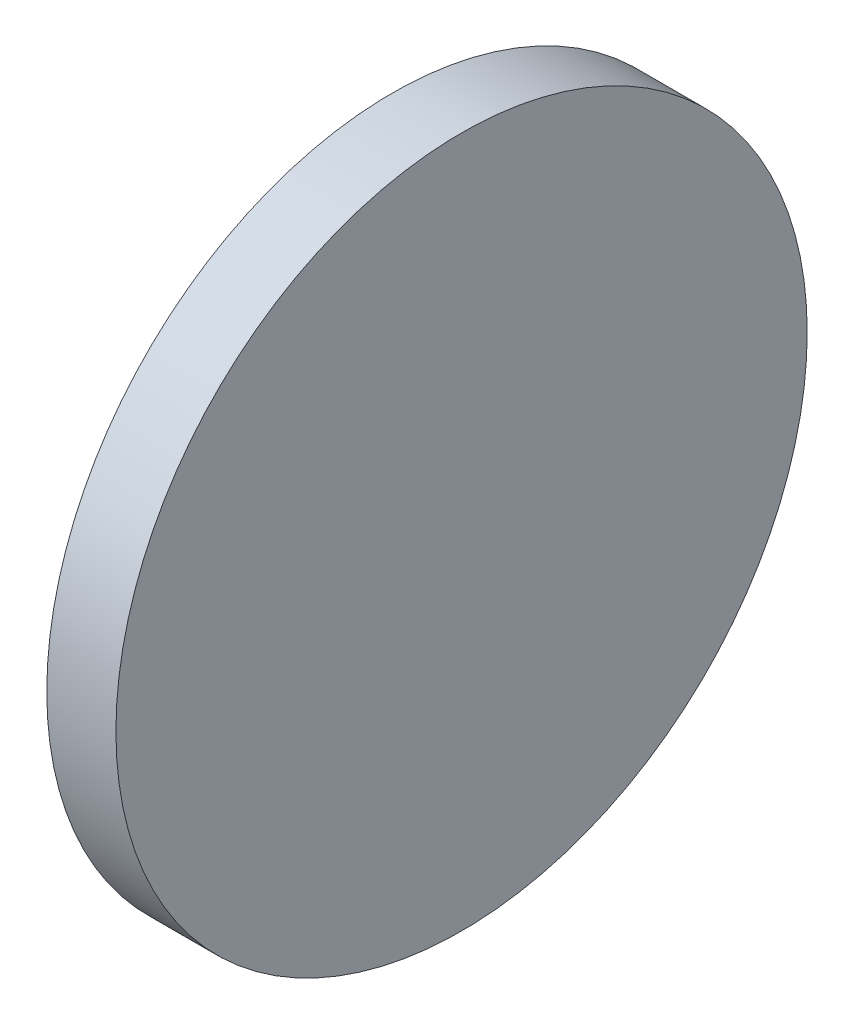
ISO-10303-21;
HEADER;
FILE_DESCRIPTION(('STEP AP214'),'2;1');
FILE_NAME('part.step','',(''),(''),'','','');
FILE_SCHEMA(('AUTOMOTIVE_DESIGN { 1 0 10303 214 1 1 1 1 }'));
ENDSEC;
DATA;
#1=APPLICATION_CONTEXT('core data for automotive mechanical design processes');
#2=APPLICATION_PROTOCOL_DEFINITION('international standard','automotive_design',2000,#1);
#3=PRODUCT_CONTEXT('',#1,'mechanical');
#4=PRODUCT('Part','Part','',(#3));
#5=PRODUCT_RELATED_PRODUCT_CATEGORY('part','',(#4));
#6=PRODUCT_DEFINITION_FORMATION('','',#4);
#7=PRODUCT_DEFINITION_CONTEXT('part definition',#1,'design');
#8=PRODUCT_DEFINITION('design','',#6,#7);
#9=PRODUCT_DEFINITION_SHAPE('','',#8);
#10=(LENGTH_UNIT() NAMED_UNIT(*) SI_UNIT(.MILLI.,.METRE.));
#11=(NAMED_UNIT(*) PLANE_ANGLE_UNIT() SI_UNIT($,.RADIAN.));
#12=(NAMED_UNIT(*) SI_UNIT($,.STERADIAN.) SOLID_ANGLE_UNIT());
#13=UNCERTAINTY_MEASURE_WITH_UNIT(LENGTH_MEASURE(1.E-05),#10,'distance_accuracy_value','');
#14=(GEOMETRIC_REPRESENTATION_CONTEXT(3) GLOBAL_UNCERTAINTY_ASSIGNED_CONTEXT((#13)) GLOBAL_UNIT_ASSIGNED_CONTEXT((#10,
#11,#12)) REPRESENTATION_CONTEXT('',''));
#15=CARTESIAN_POINT('',(0.,0.,0.));
#16=DIRECTION('',(0.,0.,1.));
#17=DIRECTION('',(1.,0.,0.));
#18=AXIS2_PLACEMENT_3D('',#15,#16,#17);
#19=CARTESIAN_POINT('',(0.381,0.,0.));
#20=DIRECTION('',(-1.,0.,0.));
#21=DIRECTION('',(0.,0.,1.));
#22=AXIS2_PLACEMENT_3D('',#19,#20,#21);
#23=CYLINDRICAL_SURFACE('',#22,1.905);
#24=CARTESIAN_POINT('',(0.381,0.,0.));
#25=DIRECTION('',(1.,0.,0.));
#26=DIRECTION('',(0.,0.,-1.));
#27=AXIS2_PLACEMENT_3D('',#24,#25,#26);
#28=CIRCLE('',#27,1.905);
#29=CARTESIAN_POINT('',(0.381,0.,1.905));
#30=VERTEX_POINT('',#29);
#31=EDGE_CURVE('E10',#30,#30,#28,.T.);
#32=CARTESIAN_POINT('',(0.,0.,0.));
#33=DIRECTION('',(1.,0.,0.));
#34=DIRECTION('',(0.,0.,-1.));
#35=AXIS2_PLACEMENT_3D('',#32,#33,#34);
#36=CIRCLE('',#35,1.905);
#37=CARTESIAN_POINT('',(0.,0.,1.905));
#38=VERTEX_POINT('',#37);
#39=EDGE_CURVE('E32',#38,#38,#36,.T.);
#40=CARTESIAN_POINT('',(0.381,0.,1.905));
#41=CARTESIAN_POINT('',(0.37703125,0.,1.905));
#42=CARTESIAN_POINT('',(0.3730625,0.,1.905));
#43=CARTESIAN_POINT('',(0.365125,0.,1.905));
#44=CARTESIAN_POINT('',(0.36115625,0.,1.905));
#45=CARTESIAN_POINT('',(0.35321875,0.,1.905));
#46=CARTESIAN_POINT('',(0.34925,0.,1.905));
#47=CARTESIAN_POINT('',(0.3413125,0.,1.905));
#48=CARTESIAN_POINT('',(0.33734375,0.,1.905));
#49=CARTESIAN_POINT('',(0.32940625,0.,1.905));
#50=CARTESIAN_POINT('',(0.3254375,0.,1.905));
#51=CARTESIAN_POINT('',(0.3175,0.,1.905));
#52=CARTESIAN_POINT('',(0.31353125,0.,1.905));
#53=CARTESIAN_POINT('',(0.30559375,0.,1.905));
#54=CARTESIAN_POINT('',(0.301625,0.,1.905));
#55=CARTESIAN_POINT('',(0.2936875,0.,1.905));
#56=CARTESIAN_POINT('',(0.28971875,0.,1.905));
#57=CARTESIAN_POINT('',(0.28178125,0.,1.905));
#58=CARTESIAN_POINT('',(0.2778125,0.,1.905));
#59=CARTESIAN_POINT('',(0.269875,0.,1.905));
#60=CARTESIAN_POINT('',(0.26590625,0.,1.905));
#61=CARTESIAN_POINT('',(0.25796875,0.,1.905));
#62=CARTESIAN_POINT('',(0.254,0.,1.905));
#63=CARTESIAN_POINT('',(0.2460625,0.,1.905));
#64=CARTESIAN_POINT('',(0.24209375,0.,1.905));
#65=CARTESIAN_POINT('',(0.23415625,0.,1.905));
#66=CARTESIAN_POINT('',(0.2301875,0.,1.905));
#67=CARTESIAN_POINT('',(0.22225,0.,1.905));
#68=CARTESIAN_POINT('',(0.21828125,0.,1.905));
#69=CARTESIAN_POINT('',(0.21034375,0.,1.905));
#70=CARTESIAN_POINT('',(0.206375,0.,1.905));
#71=CARTESIAN_POINT('',(0.1984375,0.,1.905));
#72=CARTESIAN_POINT('',(0.19446875,0.,1.905));
#73=CARTESIAN_POINT('',(0.18653125,0.,1.905));
#74=CARTESIAN_POINT('',(0.1825625,0.,1.905));
#75=CARTESIAN_POINT('',(0.174625,0.,1.905));
#76=CARTESIAN_POINT('',(0.17065625,0.,1.905));
#77=CARTESIAN_POINT('',(0.16271875,0.,1.905));
#78=CARTESIAN_POINT('',(0.15875,0.,1.905));
#79=CARTESIAN_POINT('',(0.1508125,0.,1.905));
#80=CARTESIAN_POINT('',(0.14684375,0.,1.905));
#81=CARTESIAN_POINT('',(0.13890625,0.,1.905));
#82=CARTESIAN_POINT('',(0.1349375,0.,1.905));
#83=CARTESIAN_POINT('',(0.127,0.,1.905));
#84=CARTESIAN_POINT('',(0.12303125,0.,1.905));
#85=CARTESIAN_POINT('',(0.11509375,0.,1.905));
#86=CARTESIAN_POINT('',(0.111125,0.,1.905));
#87=CARTESIAN_POINT('',(0.1031875,0.,1.905));
#88=CARTESIAN_POINT('',(0.09921875,0.,1.905));
#89=CARTESIAN_POINT('',(0.09128125,0.,1.905));
#90=CARTESIAN_POINT('',(0.0873125,0.,1.905));
#91=CARTESIAN_POINT('',(0.079375,0.,1.905));
#92=CARTESIAN_POINT('',(0.07540625,0.,1.905));
#93=CARTESIAN_POINT('',(0.06746875,0.,1.905));
#94=CARTESIAN_POINT('',(0.0635,0.,1.905));
#95=CARTESIAN_POINT('',(0.0555625,0.,1.905));
#96=CARTESIAN_POINT('',(0.05159375,0.,1.905));
#97=CARTESIAN_POINT('',(0.04365625,0.,1.905));
#98=CARTESIAN_POINT('',(0.0396875,0.,1.905));
#99=CARTESIAN_POINT('',(0.03175,0.,1.905));
#100=CARTESIAN_POINT('',(0.02778125,0.,1.905));
#101=CARTESIAN_POINT('',(0.01984375,0.,1.905));
#102=CARTESIAN_POINT('',(0.015875,0.,1.905));
#103=CARTESIAN_POINT('',(0.00793749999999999,0.,1.905));
#104=CARTESIAN_POINT('',(0.00396874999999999,0.,1.905));
#105=CARTESIAN_POINT('',(0.,0.,1.905));
#106=B_SPLINE_CURVE_WITH_KNOTS('',3,(#40,#41,#42,#43,#44,#45,#46,#47,#48,#49,#50,#51,#52,#53,
#54,#55,#56,#57,#58,#59,#60,#61,#62,#63,#64,#65,#66,#67,#68,#69,#70,#71,#72,#73,#74,#75,#76,#77,
#78,#79,#80,#81,#82,#83,#84,#85,#86,#87,#88,#89,#90,#91,#92,#93,#94,#95,#96,#97,#98,#99,#100,
#101,#102,#103,#104,#105),.UNSPECIFIED.,.F.,.F.,(4,2,2,2,2,2,2,2,2,2,2,2,2,2,2,2,2,2,2,2,2,2,2,
2,2,2,2,2,2,2,2,2,4),(0.,0.01190625,0.0238125,0.0357187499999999,0.047625,0.05953125,
0.0714374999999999,0.08334375,0.09525,0.10715625,0.1190625,0.13096875,0.142875,0.15478125,
0.1666875,0.17859375,0.1905,0.20240625,0.2143125,0.22621875,0.238125,0.25003125,0.2619375,
0.27384375,0.28575,0.29765625,0.3095625,0.32146875,0.333375,0.34528125,0.3571875,0.36909375,
0.381),.UNSPECIFIED.);
#107=EDGE_CURVE('BSEAM29',#30,#38,#106,.T.);
#108=ORIENTED_EDGE('',*,*,#31,.F.);
#109=ORIENTED_EDGE('',*,*,#39,.T.);
#110=ORIENTED_EDGE('',*,*,#107,.T.);
#111=ORIENTED_EDGE('',*,*,#107,.F.);
#112=EDGE_LOOP('',(#108,#110,#109,#111));
#113=FACE_BOUND('',#112,.T.);
#114=ADVANCED_FACE('F29',(#113),#23,.T.);
#115=CARTESIAN_POINT('',(0.381,0.,0.));
#116=DIRECTION('',(1.,0.,0.));
#117=DIRECTION('',(0.,0.,-1.));
#118=AXIS2_PLACEMENT_3D('',#115,#116,#117);
#119=PLANE('',#118);
#120=ORIENTED_EDGE('',*,*,#31,.T.);
#121=EDGE_LOOP('',(#120));
#122=FACE_BOUND('',#121,.T.);
#123=ADVANCED_FACE('F44',(#122),#119,.T.);
#124=CARTESIAN_POINT('',(0.,0.,0.));
#125=DIRECTION('',(1.,0.,0.));
#126=DIRECTION('',(0.,0.,-1.));
#127=AXIS2_PLACEMENT_3D('',#124,#125,#126);
#128=PLANE('',#127);
#129=ORIENTED_EDGE('',*,*,#39,.F.);
#130=EDGE_LOOP('',(#129));
#131=FACE_BOUND('',#130,.T.);
#132=ADVANCED_FACE('F42',(#131),#128,.F.);
#133=CLOSED_SHELL('',(#114,#123,#132));
#134=MANIFOLD_SOLID_BREP('B2',#133);
#135=ADVANCED_BREP_SHAPE_REPRESENTATION('',(#18,#134),#14);
#136=SHAPE_DEFINITION_REPRESENTATION(#9,#135);
ENDSEC;
END-ISO-10303-21;
